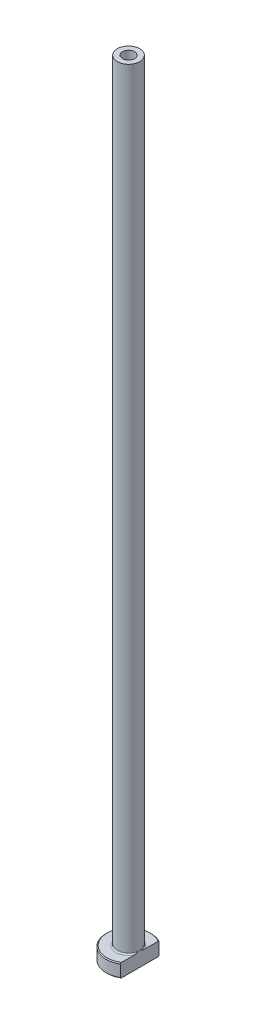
ISO-10303-21;
HEADER;
FILE_DESCRIPTION(('STEP AP214'),'2;1');
FILE_NAME('part.step','',(''),(''),'','','');
FILE_SCHEMA(('AUTOMOTIVE_DESIGN { 1 0 10303 214 1 1 1 1 }'));
ENDSEC;
DATA;
#1=APPLICATION_CONTEXT('core data for automotive mechanical design processes');
#2=APPLICATION_PROTOCOL_DEFINITION('international standard','automotive_design',2000,#1);
#3=PRODUCT_CONTEXT('',#1,'mechanical');
#4=PRODUCT('Part','Part','',(#3));
#5=PRODUCT_RELATED_PRODUCT_CATEGORY('part','',(#4));
#6=PRODUCT_DEFINITION_FORMATION('','',#4);
#7=PRODUCT_DEFINITION_CONTEXT('part definition',#1,'design');
#8=PRODUCT_DEFINITION('design','',#6,#7);
#9=PRODUCT_DEFINITION_SHAPE('','',#8);
#10=(LENGTH_UNIT() NAMED_UNIT(*) SI_UNIT(.MILLI.,.METRE.));
#11=(NAMED_UNIT(*) PLANE_ANGLE_UNIT() SI_UNIT($,.RADIAN.));
#12=(NAMED_UNIT(*) SI_UNIT($,.STERADIAN.) SOLID_ANGLE_UNIT());
#13=UNCERTAINTY_MEASURE_WITH_UNIT(LENGTH_MEASURE(1.E-05),#10,'distance_accuracy_value','');
#14=(GEOMETRIC_REPRESENTATION_CONTEXT(3) GLOBAL_UNCERTAINTY_ASSIGNED_CONTEXT((#13)) GLOBAL_UNIT_ASSIGNED_CONTEXT((#10,
#11,#12)) REPRESENTATION_CONTEXT('',''));
#15=CARTESIAN_POINT('',(0.,0.,0.));
#16=DIRECTION('',(0.,0.,1.));
#17=DIRECTION('',(1.,0.,0.));
#18=AXIS2_PLACEMENT_3D('',#15,#16,#17);
#19=CARTESIAN_POINT('',(0.,92.1876809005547,0.));
#20=DIRECTION('',(0.,1.,0.));
#21=DIRECTION('',(0.,0.,1.));
#22=AXIS2_PLACEMENT_3D('',#19,#20,#21);
#23=CYLINDRICAL_SURFACE('',#22,1.35);
#24=CARTESIAN_POINT('',(0.,175.,0.));
#25=DIRECTION('',(0.,1.,0.));
#26=DIRECTION('',(0.,0.,1.));
#27=AXIS2_PLACEMENT_3D('',#24,#25,#26);
#28=CIRCLE('',#27,1.35);
#29=CARTESIAN_POINT('',(0.,175.,1.35));
#30=VERTEX_POINT('',#29);
#31=EDGE_CURVE('E167',#30,#30,#28,.T.);
#32=ORIENTED_EDGE('',*,*,#31,.T.);
#33=EDGE_LOOP('',(#32));
#34=FACE_BOUND('',#33,.T.);
#35=CARTESIAN_POINT('',(0.,130.,0.));
#36=DIRECTION('',(0.,1.,0.));
#37=DIRECTION('',(0.,0.,1.));
#38=AXIS2_PLACEMENT_3D('',#35,#36,#37);
#39=CIRCLE('',#38,1.35);
#40=CARTESIAN_POINT('',(0.,130.,1.35));
#41=VERTEX_POINT('',#40);
#42=EDGE_CURVE('E170',#41,#41,#39,.T.);
#43=ORIENTED_EDGE('',*,*,#42,.F.);
#44=EDGE_LOOP('',(#43));
#45=FACE_BOUND('',#44,.T.);
#46=ADVANCED_FACE('F32',(#34,#45),#23,.F.);
#47=CARTESIAN_POINT('',(-1.35,175.,0.));
#48=DIRECTION('',(0.,1.,0.));
#49=DIRECTION('',(0.,0.,1.));
#50=AXIS2_PLACEMENT_3D('',#47,#48,#49);
#51=PLANE('',#50);
#52=CARTESIAN_POINT('',(0.,175.,0.));
#53=DIRECTION('',(0.,1.,0.));
#54=DIRECTION('',(0.,0.,1.));
#55=AXIS2_PLACEMENT_3D('',#52,#53,#54);
#56=CIRCLE('',#55,2.50000000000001);
#57=CARTESIAN_POINT('',(0.,175.,2.50000000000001));
#58=VERTEX_POINT('',#57);
#59=EDGE_CURVE('E174',#58,#58,#56,.T.);
#60=ORIENTED_EDGE('',*,*,#59,.T.);
#61=EDGE_LOOP('',(#60));
#62=FACE_BOUND('',#61,.T.);
#63=ORIENTED_EDGE('',*,*,#31,.F.);
#64=EDGE_LOOP('',(#63));
#65=FACE_BOUND('',#64,.T.);
#66=ADVANCED_FACE('F157',(#62,#65),#51,.T.);
#67=CARTESIAN_POINT('',(0.,92.1876809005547,0.));
#68=DIRECTION('',(0.,1.,0.));
#69=DIRECTION('',(0.,0.,1.));
#70=AXIS2_PLACEMENT_3D('',#67,#68,#69);
#71=CYLINDRICAL_SURFACE('',#70,2.5);
#72=CARTESIAN_POINT('',(0.,3.3,0.));
#73=DIRECTION('',(0.,1.,0.));
#74=DIRECTION('',(0.,0.,1.));
#75=AXIS2_PLACEMENT_3D('',#72,#73,#74);
#76=CIRCLE('',#75,2.5);
#77=CARTESIAN_POINT('',(2.5,3.3,0.));
#78=VERTEX_POINT('',#77);
#79=EDGE_CURVE('E180',#78,#78,#76,.T.);
#80=ORIENTED_EDGE('',*,*,#79,.T.);
#81=EDGE_LOOP('',(#80));
#82=FACE_BOUND('',#81,.T.);
#83=ORIENTED_EDGE('',*,*,#59,.F.);
#84=EDGE_LOOP('',(#83));
#85=FACE_BOUND('',#84,.T.);
#86=ADVANCED_FACE('F162',(#82,#85),#71,.T.);
#87=CARTESIAN_POINT('',(-2.49999999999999,3.,0.));
#88=DIRECTION('',(0.,1.,0.));
#89=DIRECTION('',(0.,0.,1.));
#90=AXIS2_PLACEMENT_3D('',#87,#88,#89);
#91=PLANE('',#90);
#92=DIRECTION('',(0.,0.,1.));
#93=VECTOR('',#92,1.);
#94=CARTESIAN_POINT('',(2.49999999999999,3.,0.));
#95=LINE('',#94,#93);
#96=CARTESIAN_POINT('',(2.5,3.,-4.09756024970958));
#97=VERTEX_POINT('',#96);
#98=CARTESIAN_POINT('',(2.49999999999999,3.,-1.26095202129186));
#99=VERTEX_POINT('',#98);
#100=EDGE_CURVE('E54',#97,#99,#95,.T.);
#101=ORIENTED_EDGE('',*,*,#100,.F.);
#102=CARTESIAN_POINT('',(0.,3.,0.));
#103=DIRECTION('',(0.,1.,0.));
#104=DIRECTION('',(0.,0.,1.));
#105=AXIS2_PLACEMENT_3D('',#102,#103,#104);
#106=CIRCLE('',#105,4.8);
#107=CARTESIAN_POINT('',(2.49999999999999,3.,4.09756024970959));
#108=VERTEX_POINT('',#107);
#109=EDGE_CURVE('E186',#97,#108,#106,.T.);
#110=ORIENTED_EDGE('',*,*,#109,.T.);
#111=CARTESIAN_POINT('',(2.49999999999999,3.,1.26095202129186));
#112=VERTEX_POINT('',#111);
#113=EDGE_CURVE('E134',#112,#108,#95,.T.);
#114=ORIENTED_EDGE('',*,*,#113,.F.);
#115=CARTESIAN_POINT('',(0.,3.,0.));
#116=DIRECTION('',(0.,1.,0.));
#117=DIRECTION('',(0.,0.,1.));
#118=AXIS2_PLACEMENT_3D('',#115,#116,#117);
#119=CIRCLE('',#118,2.8);
#120=EDGE_CURVE('E183',#112,#99,#119,.F.);
#121=ORIENTED_EDGE('',*,*,#120,.T.);
#122=EDGE_LOOP('',(#101,#110,#114,#121));
#123=FACE_BOUND('',#122,.T.);
#124=ADVANCED_FACE('F197',(#123),#91,.T.);
#125=CARTESIAN_POINT('',(0.,92.1876809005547,0.));
#126=DIRECTION('',(0.,1.,0.));
#127=DIRECTION('',(0.,0.,1.));
#128=AXIS2_PLACEMENT_3D('',#125,#126,#127);
#129=CYLINDRICAL_SURFACE('',#128,4.99999999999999);
#130=DIRECTION('',(0.,-1.,0.));
#131=VECTOR('',#130,1.);
#132=CARTESIAN_POINT('',(2.49999999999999,175.,4.33012701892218));
#133=LINE('',#132,#131);
#134=CARTESIAN_POINT('',(2.49999999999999,2.8,4.33012701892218));
#135=VERTEX_POINT('',#134);
#136=CARTESIAN_POINT('',(2.49999999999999,0.200000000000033,4.33012701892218));
#137=VERTEX_POINT('',#136);
#138=EDGE_CURVE('E82',#135,#137,#133,.T.);
#139=ORIENTED_EDGE('',*,*,#138,.F.);
#140=CARTESIAN_POINT('',(0.,2.8,0.));
#141=DIRECTION('',(0.,1.,0.));
#142=DIRECTION('',(0.,0.,1.));
#143=AXIS2_PLACEMENT_3D('',#140,#141,#142);
#144=CIRCLE('',#143,4.99999999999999);
#145=CARTESIAN_POINT('',(2.5,2.8,-4.33012701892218));
#146=VERTEX_POINT('',#145);
#147=EDGE_CURVE('E95',#135,#146,#144,.F.);
#148=ORIENTED_EDGE('',*,*,#147,.T.);
#149=DIRECTION('',(0.,-1.,0.));
#150=VECTOR('',#149,1.);
#151=CARTESIAN_POINT('',(2.5,175.,-4.33012701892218));
#152=LINE('',#151,#150);
#153=CARTESIAN_POINT('',(2.5,0.200000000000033,-4.33012701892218));
#154=VERTEX_POINT('',#153);
#155=EDGE_CURVE('E192',#146,#154,#152,.T.);
#156=ORIENTED_EDGE('',*,*,#155,.T.);
#157=CARTESIAN_POINT('',(0.,0.200000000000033,0.));
#158=DIRECTION('',(0.,-1.,0.));
#159=DIRECTION('',(0.,0.,-1.));
#160=AXIS2_PLACEMENT_3D('',#157,#158,#159);
#161=CIRCLE('',#160,4.99999999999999);
#162=EDGE_CURVE('E98',#154,#137,#161,.F.);
#163=ORIENTED_EDGE('',*,*,#162,.T.);
#164=EDGE_LOOP('',(#139,#148,#156,#163));
#165=FACE_BOUND('',#164,.T.);
#166=ADVANCED_FACE('F190',(#165),#129,.T.);
#167=CARTESIAN_POINT('',(-4.99999999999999,0.,0.));
#168=DIRECTION('',(0.,-1.,0.));
#169=DIRECTION('',(0.,0.,-1.));
#170=AXIS2_PLACEMENT_3D('',#167,#168,#169);
#171=PLANE('',#170);
#172=CARTESIAN_POINT('',(0.,0.,0.));
#173=DIRECTION('',(0.,-1.,0.));
#174=DIRECTION('',(0.,0.,-1.));
#175=AXIS2_PLACEMENT_3D('',#172,#173,#174);
#176=CIRCLE('',#175,2.09999999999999);
#177=CARTESIAN_POINT('',(0.,0.,-2.09999999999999));
#178=VERTEX_POINT('',#177);
#179=EDGE_CURVE('E40',#178,#178,#176,.F.);
#180=ORIENTED_EDGE('',*,*,#179,.T.);
#181=EDGE_LOOP('',(#180));
#182=FACE_BOUND('',#181,.T.);
#183=DIRECTION('',(0.,0.,-1.));
#184=VECTOR('',#183,1.);
#185=CARTESIAN_POINT('',(2.49999999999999,0.,4.33012701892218));
#186=LINE('',#185,#184);
#187=CARTESIAN_POINT('',(2.49999999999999,0.,4.09756024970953));
#188=VERTEX_POINT('',#187);
#189=CARTESIAN_POINT('',(2.5,0.,-4.09756024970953));
#190=VERTEX_POINT('',#189);
#191=EDGE_CURVE('E47',#188,#190,#186,.T.);
#192=ORIENTED_EDGE('',*,*,#191,.F.);
#193=CARTESIAN_POINT('',(0.,0.,0.));
#194=DIRECTION('',(0.,-1.,0.));
#195=DIRECTION('',(0.,0.,-1.));
#196=AXIS2_PLACEMENT_3D('',#193,#194,#195);
#197=CIRCLE('',#196,4.79999999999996);
#198=EDGE_CURVE('E92',#188,#190,#197,.T.);
#199=ORIENTED_EDGE('',*,*,#198,.T.);
#200=EDGE_LOOP('',(#192,#199));
#201=FACE_BOUND('',#200,.T.);
#202=ADVANCED_FACE('F91',(#182,#201),#171,.T.);
#203=CARTESIAN_POINT('',(0.,92.1876809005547,0.));
#204=DIRECTION('',(0.,1.,0.));
#205=DIRECTION('',(0.,0.,1.));
#206=AXIS2_PLACEMENT_3D('',#203,#204,#205);
#207=CYLINDRICAL_SURFACE('',#206,1.6);
#208=CARTESIAN_POINT('',(0.,0.5,0.));
#209=DIRECTION('',(0.,-1.,0.));
#210=DIRECTION('',(0.,0.,-1.));
#211=AXIS2_PLACEMENT_3D('',#208,#209,#210);
#212=CIRCLE('',#211,1.6);
#213=CARTESIAN_POINT('',(0.,0.5,-1.6));
#214=VERTEX_POINT('',#213);
#215=EDGE_CURVE('E11',#214,#214,#212,.T.);
#216=ORIENTED_EDGE('',*,*,#215,.T.);
#217=EDGE_LOOP('',(#216));
#218=FACE_BOUND('',#217,.T.);
#219=CARTESIAN_POINT('',(0.,118.,0.));
#220=DIRECTION('',(0.,1.,0.));
#221=DIRECTION('',(0.,0.,1.));
#222=AXIS2_PLACEMENT_3D('',#219,#220,#221);
#223=CIRCLE('',#222,1.6);
#224=CARTESIAN_POINT('',(0.,118.,1.6));
#225=VERTEX_POINT('',#224);
#226=EDGE_CURVE('E172',#225,#225,#223,.T.);
#227=ORIENTED_EDGE('',*,*,#226,.T.);
#228=EDGE_LOOP('',(#227));
#229=FACE_BOUND('',#228,.T.);
#230=ADVANCED_FACE('F215',(#218,#229),#207,.F.);
#231=CARTESIAN_POINT('',(0.,118.,0.));
#232=DIRECTION('',(0.,-1.,0.));
#233=DIRECTION('',(0.,0.,-1.));
#234=AXIS2_PLACEMENT_3D('',#231,#232,#233);
#235=CONICAL_SURFACE('',#234,1.6,0.0208303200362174);
#236=ORIENTED_EDGE('',*,*,#42,.T.);
#237=EDGE_LOOP('',(#236));
#238=FACE_BOUND('',#237,.T.);
#239=ORIENTED_EDGE('',*,*,#226,.F.);
#240=EDGE_LOOP('',(#239));
#241=FACE_BOUND('',#240,.T.);
#242=ADVANCED_FACE('F111',(#238,#241),#235,.F.);
#243=CARTESIAN_POINT('',(0.,3.3,0.));
#244=DIRECTION('',(0.,1.,0.));
#245=DIRECTION('',(0.,0.,1.));
#246=AXIS2_PLACEMENT_3D('',#243,#244,#245);
#247=TOROIDAL_SURFACE('',#246,2.8,0.3);
#248=ORIENTED_EDGE('',*,*,#120,.F.);
#249=CARTESIAN_POINT('',(2.5,3.3,0.));
#250=CARTESIAN_POINT('',(2.5,3.3000006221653,-4.84273808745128E-11));
#251=CARTESIAN_POINT('',(2.5,3.30000124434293,1.59621022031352E-07));
#252=CARTESIAN_POINT('',(2.5,3.30000243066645,6.45477892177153E-07));
#253=CARTESIAN_POINT('',(2.5,3.3000029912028,9.78480613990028E-07));
#254=CARTESIAN_POINT('',(2.5,3.3000041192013,1.77471968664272E-06));
#255=CARTESIAN_POINT('',(2.5,3.30000467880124,2.249021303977E-06));
#256=CARTESIAN_POINT('',(2.5,3.30000572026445,3.25953665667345E-06));
#257=CARTESIAN_POINT('',(2.5,3.30000620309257,3.79480728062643E-06));
#258=CARTESIAN_POINT('',(2.5,3.3000078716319,5.75794615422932E-06));
#259=CARTESIAN_POINT('',(2.5,3.30000896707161,7.2642410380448E-06));
#260=CARTESIAN_POINT('',(2.5,3.30001087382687,1.0336112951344E-05));
#261=CARTESIAN_POINT('',(2.5,3.30001169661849,1.18949499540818E-05));
#262=CARTESIAN_POINT('',(2.5,3.30001489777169,1.81400853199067E-05));
#263=CARTESIAN_POINT('',(2.5,3.300017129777,2.29062180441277E-05));
#264=CARTESIAN_POINT('',(2.5,3.30002067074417,3.21793870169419E-05));
#265=CARTESIAN_POINT('',(2.5,3.30002205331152,3.66588991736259E-05));
#266=CARTESIAN_POINT('',(2.5,3.30002810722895,5.61718409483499E-05));
#267=CARTESIAN_POINT('',(2.5,3.30003284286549,7.11735872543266E-05));
#268=CARTESIAN_POINT('',(2.49999999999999,3.30004025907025,9.89920336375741E-05));
#269=CARTESIAN_POINT('',(2.5,3.3000431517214,0.000111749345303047));
#270=CARTESIAN_POINT('',(2.5,3.30006652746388,0.000206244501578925));
#271=CARTESIAN_POINT('',(2.5,3.30009698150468,0.000285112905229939));
#272=CARTESIAN_POINT('',(2.49999999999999,3.30021213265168,0.000594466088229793));
#273=CARTESIAN_POINT('',(2.49999999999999,3.30028938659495,0.000826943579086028));
#274=CARTESIAN_POINT('',(2.5,3.30059681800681,0.0017388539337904));
#275=CARTESIAN_POINT('',(2.5,3.30083479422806,0.00241625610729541));
#276=CARTESIAN_POINT('',(2.49999999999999,3.30181198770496,0.00521069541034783));
#277=CARTESIAN_POINT('',(2.49999999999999,3.30254240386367,0.0073299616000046));
#278=CARTESIAN_POINT('',(2.5,3.31226043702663,0.0355096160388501));
#279=CARTESIAN_POINT('',(2.5,3.32130808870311,0.0615551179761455));
#280=CARTESIAN_POINT('',(2.49999999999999,3.33896212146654,0.112677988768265));
#281=CARTESIAN_POINT('',(2.49999999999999,3.34757212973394,0.137754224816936));
#282=CARTESIAN_POINT('',(2.5,3.36573068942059,0.190981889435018));
#283=CARTESIAN_POINT('',(2.5,3.37526654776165,0.219137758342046));
#284=CARTESIAN_POINT('',(2.5,3.39422867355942,0.275816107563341));
#285=CARTESIAN_POINT('',(2.5,3.40365272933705,0.304339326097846));
#286=CARTESIAN_POINT('',(2.5,3.42641697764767,0.374416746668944));
#287=CARTESIAN_POINT('',(2.5,3.43959811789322,0.416023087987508));
#288=CARTESIAN_POINT('',(2.5,3.46479157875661,0.49848190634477));
#289=CARTESIAN_POINT('',(2.5,3.47682455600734,0.539328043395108));
#290=CARTESIAN_POINT('',(2.5,3.50224427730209,0.629981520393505));
#291=CARTESIAN_POINT('',(2.5,3.51538048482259,0.679860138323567));
#292=CARTESIAN_POINT('',(2.5,3.53964074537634,0.7805117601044));
#293=CARTESIAN_POINT('',(2.5,3.55074877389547,0.831288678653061));
#294=CARTESIAN_POINT('',(2.5,3.57087054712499,0.937063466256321));
#295=CARTESIAN_POINT('',(2.5,3.57967623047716,0.992102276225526));
#296=CARTESIAN_POINT('',(2.5,3.59301148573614,1.10256024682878));
#297=CARTESIAN_POINT('',(2.5,3.59755297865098,1.15797790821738));
#298=CARTESIAN_POINT('',(2.5,3.60093314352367,1.26786705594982));
#299=CARTESIAN_POINT('',(2.5,3.59989366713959,1.32233291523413));
#300=CARTESIAN_POINT('',(2.5,3.59277279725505,1.40310062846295));
#301=CARTESIAN_POINT('',(2.5,3.58952137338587,1.42965222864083));
#302=CARTESIAN_POINT('',(2.5,3.58085857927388,1.48239078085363));
#303=CARTESIAN_POINT('',(2.5,3.57544928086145,1.50857805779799));
#304=CARTESIAN_POINT('',(2.5,3.56298810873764,1.55658799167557));
#305=CARTESIAN_POINT('',(2.5,3.5562820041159,1.5784990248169));
#306=CARTESIAN_POINT('',(2.5,3.5405539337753,1.62160292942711));
#307=CARTESIAN_POINT('',(2.5,3.5315222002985,1.64279233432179));
#308=CARTESIAN_POINT('',(2.5,3.51057199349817,1.68404469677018));
#309=CARTESIAN_POINT('',(2.5,3.49862012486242,1.70409105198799));
#310=CARTESIAN_POINT('',(2.5,3.47134074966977,1.74172093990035));
#311=CARTESIAN_POINT('',(2.5,3.45603127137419,1.75931683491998));
#312=CARTESIAN_POINT('',(2.5,3.42979930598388,1.78297070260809));
#313=CARTESIAN_POINT('',(2.5,3.42024268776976,1.79054141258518));
#314=CARTESIAN_POINT('',(2.5,3.40009035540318,1.80416997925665));
#315=CARTESIAN_POINT('',(2.5,3.3894949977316,1.81022835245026));
#316=CARTESIAN_POINT('',(2.5,3.36727740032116,1.82047087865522));
#317=CARTESIAN_POINT('',(2.5,3.3556453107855,1.82463409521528));
#318=CARTESIAN_POINT('',(2.5,3.33178837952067,1.83058442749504));
#319=CARTESIAN_POINT('',(2.5,3.31956435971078,1.83237474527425));
#320=CARTESIAN_POINT('',(2.5,3.29665736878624,1.83331852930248));
#321=CARTESIAN_POINT('',(2.5,3.2859867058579,1.83279233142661));
#322=CARTESIAN_POINT('',(2.5,3.26490749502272,1.82986307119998));
#323=CARTESIAN_POINT('',(2.5,3.25449899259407,1.82745968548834));
#324=CARTESIAN_POINT('',(2.5,3.23467098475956,1.82111257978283));
#325=CARTESIAN_POINT('',(2.5,3.22522816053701,1.81724026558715));
#326=CARTESIAN_POINT('',(2.5,3.20699535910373,1.80819497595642));
#327=CARTESIAN_POINT('',(2.5,3.19820556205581,1.80302164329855));
#328=CARTESIAN_POINT('',(2.5,3.17663162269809,1.78842115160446));
#329=CARTESIAN_POINT('',(2.5,3.16436228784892,1.7782329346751));
#330=CARTESIAN_POINT('',(2.5,3.14157828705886,1.75604629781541));
#331=CARTESIAN_POINT('',(2.5,3.13106906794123,1.74404246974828));
#332=CARTESIAN_POINT('',(2.5,3.10600520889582,1.71142114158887));
#333=CARTESIAN_POINT('',(2.5,3.09267476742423,1.68986887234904));
#334=CARTESIAN_POINT('',(2.5,3.06940323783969,1.64508572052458));
#335=CARTESIAN_POINT('',(2.5,3.05946314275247,1.62185434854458));
#336=CARTESIAN_POINT('',(2.5,3.03545750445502,1.55546754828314));
#337=CARTESIAN_POINT('',(2.5,3.02444022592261,1.51122187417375));
#338=CARTESIAN_POINT('',(2.5,3.00863926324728,1.4211977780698));
#339=CARTESIAN_POINT('',(2.5,3.00393876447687,1.37540689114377));
#340=CARTESIAN_POINT('',(2.5,2.9992421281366,1.28072198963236));
#341=CARTESIAN_POINT('',(2.5,2.99956098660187,1.23181420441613));
#342=CARTESIAN_POINT('',(2.5,3.00436098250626,1.13410944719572));
#343=CARTESIAN_POINT('',(2.5,3.00885327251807,1.0853131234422));
#344=CARTESIAN_POINT('',(2.5,3.02074191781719,0.990773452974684));
#345=CARTESIAN_POINT('',(2.5,3.02796792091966,0.94500781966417));
#346=CARTESIAN_POINT('',(2.5,3.04465555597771,0.854199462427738));
#347=CARTESIAN_POINT('',(2.5,3.05410250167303,0.809153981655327));
#348=CARTESIAN_POINT('',(2.5,3.07710029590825,0.709411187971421));
#349=CARTESIAN_POINT('',(2.5,3.09109633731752,0.654817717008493));
#350=CARTESIAN_POINT('',(2.5,3.12140740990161,0.54486362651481));
#351=CARTESIAN_POINT('',(2.49999999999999,3.13777040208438,0.489516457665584));
#352=CARTESIAN_POINT('',(2.5,3.16649540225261,0.396740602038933));
#353=CARTESIAN_POINT('',(2.5,3.17848130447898,0.359193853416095));
#354=CARTESIAN_POINT('',(2.49999999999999,3.20280507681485,0.284651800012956));
#355=CARTESIAN_POINT('',(2.49999999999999,3.21513791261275,0.247654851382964));
#356=CARTESIAN_POINT('',(2.5,3.23873713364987,0.177767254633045));
#357=CARTESIAN_POINT('',(2.5,3.24997409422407,0.144866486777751));
#358=CARTESIAN_POINT('',(2.49999999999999,3.27307149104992,0.0777985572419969));
#359=CARTESIAN_POINT('',(2.49999999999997,3.28493883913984,0.0436336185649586));
#360=CARTESIAN_POINT('',(2.5,3.29745794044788,0.0073287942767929));
#361=CARTESIAN_POINT('',(2.5,3.29818879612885,0.00520838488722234));
#362=CARTESIAN_POINT('',(2.49999999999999,3.29916610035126,0.00241367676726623));
#363=CARTESIAN_POINT('',(2.49999999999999,3.29940376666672,0.00173715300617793));
#364=CARTESIAN_POINT('',(2.5,3.29971082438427,0.000826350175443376));
#365=CARTESIAN_POINT('',(2.5,3.29978800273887,0.000594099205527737));
#366=CARTESIAN_POINT('',(2.49999999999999,3.299903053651,0.000285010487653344));
#367=CARTESIAN_POINT('',(2.49999999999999,3.2999334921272,0.000206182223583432));
#368=CARTESIAN_POINT('',(2.5,3.29995685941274,0.000111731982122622));
#369=CARTESIAN_POINT('',(2.5,3.29995975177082,9.89774327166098E-05));
#370=CARTESIAN_POINT('',(2.5,3.29996716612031,7.11651886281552E-05));
#371=CARTESIAN_POINT('',(2.5,3.29997189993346,5.61668096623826E-05));
#372=CARTESIAN_POINT('',(2.5,3.29997795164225,3.66576327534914E-05));
#373=CARTESIAN_POINT('',(2.5,3.2999793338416,3.21785244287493E-05));
#374=CARTESIAN_POINT('',(2.5,3.29998287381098,2.29061373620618E-05));
#375=CARTESIAN_POINT('',(2.5,3.2999851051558,1.81403659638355E-05));
#376=CARTESIAN_POINT('',(2.5,3.29998830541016,1.1895582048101E-05));
#377=CARTESIAN_POINT('',(2.5,3.29998912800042,1.03367760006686E-05));
#378=CARTESIAN_POINT('',(2.5,3.29999103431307,7.26492761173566E-06));
#379=CARTESIAN_POINT('',(2.5,3.29999212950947,5.75862257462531E-06));
#380=CARTESIAN_POINT('',(2.5,3.2999937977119,3.79542444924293E-06));
#381=CARTESIAN_POINT('',(2.5,3.29999428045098,3.26012738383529E-06));
#382=CARTESIAN_POINT('',(2.5,3.29999532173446,2.2495431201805E-06));
#383=CARTESIAN_POINT('',(2.5,3.29999588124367,1.77519875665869E-06));
#384=CARTESIAN_POINT('',(2.5,3.29999700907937,9.78856956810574E-07));
#385=CARTESIAN_POINT('',(2.5,3.29999756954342,6.45796946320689E-07));
#386=CARTESIAN_POINT('',(2.5,3.2999987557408,1.59799561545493E-07));
#387=CARTESIAN_POINT('',(2.5,3.29999937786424,4.84255823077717E-11));
#388=CARTESIAN_POINT('',(2.5,3.3,0.));
#389=B_SPLINE_CURVE_WITH_KNOTS('',3,(#249,#250,#251,#252,#253,#254,#255,#256,#257,#258,#259,
#260,#261,#262,#263,#264,#265,#266,#267,#268,#269,#270,#271,#272,#273,#274,#275,#276,#277,#278,
#279,#280,#281,#282,#283,#284,#285,#286,#287,#288,#289,#290,#291,#292,#293,#294,#295,#296,#297,
#298,#299,#300,#301,#302,#303,#304,#305,#306,#307,#308,#309,#310,#311,#312,#313,#314,#315,#316,
#317,#318,#319,#320,#321,#322,#323,#324,#325,#326,#327,#328,#329,#330,#331,#332,#333,#334,#335,
#336,#337,#338,#339,#340,#341,#342,#343,#344,#345,#346,#347,#348,#349,#350,#351,#352,#353,#354,
#355,#356,#357,#358,#359,#360,#361,#362,#363,#364,#365,#366,#367,#368,#369,#370,#371,#372,#373,
#374,#375,#376,#377,#378,#379,#380,#381,#382,#383,#384,#385,#386,#387,#388),.UNSPECIFIED.,.T.,
.F.,(4,2,2,2,2,2,2,2,2,2,2,2,2,2,2,2,2,2,2,2,2,2,2,2,2,2,2,2,2,2,2,2,2,2,2,2,2,2,2,2,2,2,2,2,2,
2,2,2,2,2,2,2,2,2,2,2,2,2,2,2,2,2,2,2,2,2,2,2,2,4),(0.,1.86789240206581E-06,
3.81549625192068E-06,6.00610486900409E-06,8.16652987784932E-06,1.37285591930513E-05,
1.90122173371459E-05,3.47597293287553E-05,4.88082622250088E-05,9.59978452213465E-05,
0.000135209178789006,0.000388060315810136,0.00112364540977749,0.0032767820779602,
0.0100024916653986,0.0927120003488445,0.172253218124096,0.261432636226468,0.351551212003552,
0.48247714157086,0.610212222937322,0.76491521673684,0.920792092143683,1.08787897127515,
1.25449733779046,1.41749285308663,1.49767530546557,1.57778095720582,1.6464248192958,
1.71536183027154,1.78512750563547,1.8545273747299,1.89099315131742,1.92744645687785,
1.96429324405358,2.00109025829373,2.0329710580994,2.06485735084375,2.09535926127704,
2.12586955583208,2.17344034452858,2.2211557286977,2.29675134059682,2.37236907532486,
2.50839721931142,2.64619971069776,2.79268284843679,2.93955855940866,3.07848421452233,
3.21651583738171,3.38554045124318,3.55865938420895,3.67689643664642,3.79388863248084,
3.89819085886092,4.00668323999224,4.01341261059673,4.01556295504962,4.01629782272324,
4.01655054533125,4.01658974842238,4.01663692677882,4.01665097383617,4.01666671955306,
4.01667200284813,4.01667756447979,4.01667972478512,4.01668191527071,4.01668386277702,
4.01668573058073),.UNSPECIFIED.);
#390=EDGE_CURVE('E126',#112,#78,#389,.T.);
#391=ORIENTED_EDGE('',*,*,#390,.T.);
#392=ORIENTED_EDGE('',*,*,#79,.F.);
#393=CARTESIAN_POINT('',(2.5,3.3,0.));
#394=CARTESIAN_POINT('',(2.5,3.2999993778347,4.84277324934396E-11));
#395=CARTESIAN_POINT('',(2.5,3.29999875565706,-1.596210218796E-07));
#396=CARTESIAN_POINT('',(2.5,3.29999756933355,-6.45477892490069E-07));
#397=CARTESIAN_POINT('',(2.5,3.2999970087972,-9.78480614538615E-07));
#398=CARTESIAN_POINT('',(2.5,3.2999958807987,-1.77471968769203E-06));
#399=CARTESIAN_POINT('',(2.5,3.29999532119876,-2.2490213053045E-06));
#400=CARTESIAN_POINT('',(2.5,3.29999427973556,-3.25953665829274E-06));
#401=CARTESIAN_POINT('',(2.5,3.29999379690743,-3.79480728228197E-06));
#402=CARTESIAN_POINT('',(2.5,3.2999921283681,-5.75794615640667E-06));
#403=CARTESIAN_POINT('',(2.5,3.29999103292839,-7.26424104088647E-06));
#404=CARTESIAN_POINT('',(2.5,3.29998912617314,-1.03361129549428E-05));
#405=CARTESIAN_POINT('',(2.5,3.29998830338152,-1.18949499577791E-05));
#406=CARTESIAN_POINT('',(2.5,3.29998510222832,-1.81400853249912E-05));
#407=CARTESIAN_POINT('',(2.5,3.29998287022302,-2.29062180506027E-05));
#408=CARTESIAN_POINT('',(2.5,3.29997932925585,-3.21793870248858E-05));
#409=CARTESIAN_POINT('',(2.5,3.2999779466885,-3.66588991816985E-05));
#410=CARTESIAN_POINT('',(2.5,3.29997189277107,-5.61718409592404E-05));
#411=CARTESIAN_POINT('',(2.5,3.29996715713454,-7.11735872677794E-05));
#412=CARTESIAN_POINT('',(2.5,3.29995974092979,-9.89920336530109E-05));
#413=CARTESIAN_POINT('',(2.5,3.29995684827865,-0.000111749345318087));
#414=CARTESIAN_POINT('',(2.49999999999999,3.29993347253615,-0.000206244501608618));
#415=CARTESIAN_POINT('',(2.49999999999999,3.29990301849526,-0.000285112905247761));
#416=CARTESIAN_POINT('',(2.5,3.29978786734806,-0.000594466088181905));
#417=CARTESIAN_POINT('',(2.5,3.29971061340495,-0.000826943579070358));
#418=CARTESIAN_POINT('',(2.49999999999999,3.29940318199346,-0.00173885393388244));
#419=CARTESIAN_POINT('',(2.49999999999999,3.29916520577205,-0.00241625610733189));
#420=CARTESIAN_POINT('',(2.5,3.29818801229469,-0.00521069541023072));
#421=CARTESIAN_POINT('',(2.5,3.29745759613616,-0.00732996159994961));
#422=CARTESIAN_POINT('',(2.49999999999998,3.28773956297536,-0.0355096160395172));
#423=CARTESIAN_POINT('',(2.49999999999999,3.27869191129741,-0.061555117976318));
#424=CARTESIAN_POINT('',(2.5,3.26103787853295,-0.112677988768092));
#425=CARTESIAN_POINT('',(2.5,3.25242787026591,-0.137754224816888));
#426=CARTESIAN_POINT('',(2.49999999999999,3.23426931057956,-0.190981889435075));
#427=CARTESIAN_POINT('',(2.49999999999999,3.22473345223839,-0.219137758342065));
#428=CARTESIAN_POINT('',(2.5,3.20577132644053,-0.275816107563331));
#429=CARTESIAN_POINT('',(2.5,3.19634727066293,-0.304339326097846));
#430=CARTESIAN_POINT('',(2.5,3.17358302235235,-0.374416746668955));
#431=CARTESIAN_POINT('',(2.5,3.16040188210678,-0.416023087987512));
#432=CARTESIAN_POINT('',(2.5,3.13520842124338,-0.498481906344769));
#433=CARTESIAN_POINT('',(2.5,3.12317544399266,-0.539328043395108));
#434=CARTESIAN_POINT('',(2.5,3.0977557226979,-0.629981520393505));
#435=CARTESIAN_POINT('',(2.5,3.0846195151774,-0.679860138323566));
#436=CARTESIAN_POINT('',(2.5,3.06035925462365,-0.780511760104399));
#437=CARTESIAN_POINT('',(2.5,3.04925122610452,-0.83128867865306));
#438=CARTESIAN_POINT('',(2.5,3.02912945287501,-0.93706346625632));
#439=CARTESIAN_POINT('',(2.5,3.02032376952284,-0.992102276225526));
#440=CARTESIAN_POINT('',(2.5,3.00698851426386,-1.10256024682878));
#441=CARTESIAN_POINT('',(2.5,3.00244702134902,-1.15797790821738));
#442=CARTESIAN_POINT('',(2.5,2.99906685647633,-1.26786705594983));
#443=CARTESIAN_POINT('',(2.5,3.00010633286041,-1.32233291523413));
#444=CARTESIAN_POINT('',(2.5,3.00722720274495,-1.40310062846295));
#445=CARTESIAN_POINT('',(2.5,3.01047862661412,-1.42965222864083));
#446=CARTESIAN_POINT('',(2.5,3.01914142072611,-1.48239078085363));
#447=CARTESIAN_POINT('',(2.5,3.02455071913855,-1.508578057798));
#448=CARTESIAN_POINT('',(2.5,3.03701189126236,-1.55658799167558));
#449=CARTESIAN_POINT('',(2.5,3.0437179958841,-1.57849902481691));
#450=CARTESIAN_POINT('',(2.5,3.0594460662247,-1.62160292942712));
#451=CARTESIAN_POINT('',(2.5,3.06847779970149,-1.64279233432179));
#452=CARTESIAN_POINT('',(2.5,3.08942800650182,-1.68404469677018));
#453=CARTESIAN_POINT('',(2.5,3.10137987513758,-1.70409105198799));
#454=CARTESIAN_POINT('',(2.5,3.12865925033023,-1.74172093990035));
#455=CARTESIAN_POINT('',(2.5,3.14396872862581,-1.75931683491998));
#456=CARTESIAN_POINT('',(2.5,3.17020069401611,-1.78297070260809));
#457=CARTESIAN_POINT('',(2.5,3.17975731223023,-1.79054141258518));
#458=CARTESIAN_POINT('',(2.5,3.19990964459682,-1.80416997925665));
#459=CARTESIAN_POINT('',(2.5,3.21050500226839,-1.81022835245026));
#460=CARTESIAN_POINT('',(2.5,3.23272259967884,-1.82047087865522));
#461=CARTESIAN_POINT('',(2.5,3.2443546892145,-1.82463409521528));
#462=CARTESIAN_POINT('',(2.5,3.26821162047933,-1.83058442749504));
#463=CARTESIAN_POINT('',(2.5,3.28043564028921,-1.83237474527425));
#464=CARTESIAN_POINT('',(2.5,3.30334263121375,-1.83331852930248));
#465=CARTESIAN_POINT('',(2.5,3.3140132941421,-1.83279233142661));
#466=CARTESIAN_POINT('',(2.5,3.33509250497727,-1.82986307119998));
#467=CARTESIAN_POINT('',(2.5,3.34550100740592,-1.82745968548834));
#468=CARTESIAN_POINT('',(2.5,3.36532901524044,-1.82111257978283));
#469=CARTESIAN_POINT('',(2.5,3.37477183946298,-1.81724026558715));
#470=CARTESIAN_POINT('',(2.5,3.39300464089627,-1.80819497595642));
#471=CARTESIAN_POINT('',(2.5,3.40179443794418,-1.80302164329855));
#472=CARTESIAN_POINT('',(2.5,3.4233683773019,-1.78842115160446));
#473=CARTESIAN_POINT('',(2.5,3.43563771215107,-1.7782329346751));
#474=CARTESIAN_POINT('',(2.5,3.45842171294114,-1.75604629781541));
#475=CARTESIAN_POINT('',(2.5,3.46893093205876,-1.74404246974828));
#476=CARTESIAN_POINT('',(2.5,3.49399479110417,-1.71142114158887));
#477=CARTESIAN_POINT('',(2.5,3.50732523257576,-1.68986887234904));
#478=CARTESIAN_POINT('',(2.5,3.53059676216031,-1.64508572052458));
#479=CARTESIAN_POINT('',(2.5,3.54053685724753,-1.62185434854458));
#480=CARTESIAN_POINT('',(2.5,3.56454249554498,-1.55546754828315));
#481=CARTESIAN_POINT('',(2.5,3.57555977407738,-1.51122187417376));
#482=CARTESIAN_POINT('',(2.5,3.59136073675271,-1.4211977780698));
#483=CARTESIAN_POINT('',(2.5,3.59606123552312,-1.37540689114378));
#484=CARTESIAN_POINT('',(2.5,3.6007578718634,-1.28072198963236));
#485=CARTESIAN_POINT('',(2.5,3.60043901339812,-1.23181420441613));
#486=CARTESIAN_POINT('',(2.5,3.59563901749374,-1.13410944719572));
#487=CARTESIAN_POINT('',(2.5,3.59114672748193,-1.08531312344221));
#488=CARTESIAN_POINT('',(2.5,3.57925808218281,-0.990773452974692));
#489=CARTESIAN_POINT('',(2.5,3.57203207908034,-0.945007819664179));
#490=CARTESIAN_POINT('',(2.5,3.55534444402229,-0.854199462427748));
#491=CARTESIAN_POINT('',(2.5,3.54589749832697,-0.809153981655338));
#492=CARTESIAN_POINT('',(2.5,3.52289970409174,-0.709411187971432));
#493=CARTESIAN_POINT('',(2.5,3.50890366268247,-0.654817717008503));
#494=CARTESIAN_POINT('',(2.5,3.47859259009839,-0.544863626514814));
#495=CARTESIAN_POINT('',(2.49999999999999,3.46222959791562,-0.489516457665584));
#496=CARTESIAN_POINT('',(2.5,3.43350459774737,-0.396740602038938));
#497=CARTESIAN_POINT('',(2.5,3.42151869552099,-0.359193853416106));
#498=CARTESIAN_POINT('',(2.49999999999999,3.39719492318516,-0.284651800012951));
#499=CARTESIAN_POINT('',(2.49999999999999,3.38486208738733,-0.247654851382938));
#500=CARTESIAN_POINT('',(2.5,3.36126286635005,-0.177767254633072));
#501=CARTESIAN_POINT('',(2.5,3.35002590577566,-0.144866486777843));
#502=CARTESIAN_POINT('',(2.49999999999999,3.32692850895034,-0.0777985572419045));
#503=CARTESIAN_POINT('',(2.49999999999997,3.31506116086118,-0.0436336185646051));
#504=CARTESIAN_POINT('',(2.5,3.30254205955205,-0.00732879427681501));
#505=CARTESIAN_POINT('',(2.5,3.30181120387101,-0.00520838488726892));
#506=CARTESIAN_POINT('',(2.49999999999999,3.30083389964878,-0.00241367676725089));
#507=CARTESIAN_POINT('',(2.49999999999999,3.30059623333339,-0.00173715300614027));
#508=CARTESIAN_POINT('',(2.5,3.30028917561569,-0.000826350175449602));
#509=CARTESIAN_POINT('',(2.5,3.30021199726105,-0.000594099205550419));
#510=CARTESIAN_POINT('',(2.49999999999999,3.30009694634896,-0.000285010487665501));
#511=CARTESIAN_POINT('',(2.49999999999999,3.30006650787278,-0.000206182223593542));
#512=CARTESIAN_POINT('',(2.5,3.30004314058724,-0.000111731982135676));
#513=CARTESIAN_POINT('',(2.5,3.30004024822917,-9.89774327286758E-05));
#514=CARTESIAN_POINT('',(2.5,3.30003283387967,-7.11651886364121E-05));
#515=CARTESIAN_POINT('',(2.5,3.30002810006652,-5.61668096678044E-05));
#516=CARTESIAN_POINT('',(2.5,3.30002204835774,-3.66576327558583E-05));
#517=CARTESIAN_POINT('',(2.5,3.30002066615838,-3.21785244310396E-05));
#518=CARTESIAN_POINT('',(2.5,3.300017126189,-2.29061373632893E-05));
#519=CARTESIAN_POINT('',(2.5,3.30001489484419,-1.81403659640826E-05));
#520=CARTESIAN_POINT('',(2.5,3.30001169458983,-1.18955820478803E-05));
#521=CARTESIAN_POINT('',(2.5,3.30001087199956,-1.03367760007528E-05));
#522=CARTESIAN_POINT('',(2.5,3.30000896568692,-7.26492761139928E-06));
#523=CARTESIAN_POINT('',(2.5,3.30000787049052,-5.75862257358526E-06));
#524=CARTESIAN_POINT('',(2.5,3.30000620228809,-3.79542444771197E-06));
#525=CARTESIAN_POINT('',(2.5,3.30000571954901,-3.26012738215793E-06));
#526=CARTESIAN_POINT('',(2.5,3.30000467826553,-2.24954311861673E-06));
#527=CARTESIAN_POINT('',(2.5,3.30000411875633,-1.77519875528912E-06));
#528=CARTESIAN_POINT('',(2.5,3.30000299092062,-9.78856955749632E-07));
#529=CARTESIAN_POINT('',(2.5,3.30000243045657,-6.45796945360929E-07));
#530=CARTESIAN_POINT('',(2.5,3.30000124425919,-1.59799560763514E-07));
#531=CARTESIAN_POINT('',(2.5,3.30000062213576,-4.8424932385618E-11));
#532=CARTESIAN_POINT('',(2.5,3.3,0.));
#533=B_SPLINE_CURVE_WITH_KNOTS('',3,(#393,#394,#395,#396,#397,#398,#399,#400,#401,#402,#403,
#404,#405,#406,#407,#408,#409,#410,#411,#412,#413,#414,#415,#416,#417,#418,#419,#420,#421,#422,
#423,#424,#425,#426,#427,#428,#429,#430,#431,#432,#433,#434,#435,#436,#437,#438,#439,#440,#441,
#442,#443,#444,#445,#446,#447,#448,#449,#450,#451,#452,#453,#454,#455,#456,#457,#458,#459,#460,
#461,#462,#463,#464,#465,#466,#467,#468,#469,#470,#471,#472,#473,#474,#475,#476,#477,#478,#479,
#480,#481,#482,#483,#484,#485,#486,#487,#488,#489,#490,#491,#492,#493,#494,#495,#496,#497,#498,
#499,#500,#501,#502,#503,#504,#505,#506,#507,#508,#509,#510,#511,#512,#513,#514,#515,#516,#517,
#518,#519,#520,#521,#522,#523,#524,#525,#526,#527,#528,#529,#530,#531,#532),.UNSPECIFIED.,.T.,
.F.,(4,2,2,2,2,2,2,2,2,2,2,2,2,2,2,2,2,2,2,2,2,2,2,2,2,2,2,2,2,2,2,2,2,2,2,2,2,2,2,2,2,2,2,2,2,
2,2,2,2,2,2,2,2,2,2,2,2,2,2,2,2,2,2,2,2,2,2,2,2,4),(0.,1.86789240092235E-06,
3.81549624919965E-06,6.0061048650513E-06,8.16652987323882E-06,1.37285591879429E-05,
1.90122173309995E-05,3.47597293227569E-05,4.88082622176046E-05,9.59978452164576E-05,
0.000135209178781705,0.000388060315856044,0.00112364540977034,0.00327678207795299,
0.0100024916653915,0.0927120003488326,0.172253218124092,0.261432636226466,0.35155121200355,
0.482477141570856,0.610212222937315,0.764915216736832,0.920792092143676,1.08787897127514,
1.25449733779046,1.41749285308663,1.49767530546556,1.57778095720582,1.64642481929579,
1.71536183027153,1.78512750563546,1.85452737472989,1.89099315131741,1.92744645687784,
1.96429324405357,2.00109025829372,2.03297105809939,2.06485735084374,2.09535926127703,
2.12586955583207,2.17344034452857,2.2211557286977,2.29675134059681,2.37236907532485,
2.50839721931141,2.64619971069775,2.79268284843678,2.93955855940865,3.07848421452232,
3.21651583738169,3.38554045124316,3.55865938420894,3.67689643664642,3.79388863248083,
3.89819085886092,4.00668323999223,4.01341261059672,4.01556295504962,4.01629782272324,
4.01655054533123,4.01658974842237,4.01663692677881,4.01665097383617,4.01666671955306,
4.01667200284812,4.01667756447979,4.01667972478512,4.01668191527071,4.01668386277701,
4.01668573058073),.UNSPECIFIED.);
#534=EDGE_CURVE('E135',#78,#99,#533,.T.);
#535=ORIENTED_EDGE('',*,*,#534,.T.);
#536=EDGE_LOOP('',(#248,#391,#392,#535));
#537=FACE_BOUND('',#536,.T.);
#538=ADVANCED_FACE('F141',(#537),#247,.F.);
#539=CARTESIAN_POINT('',(0.,3.,0.));
#540=DIRECTION('',(0.,-1.,0.));
#541=DIRECTION('',(0.,0.,-1.));
#542=AXIS2_PLACEMENT_3D('',#539,#540,#541);
#543=CONICAL_SURFACE('',#542,4.8,0.785398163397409);
#544=CARTESIAN_POINT('',(2.5,-2.05039133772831,-9.52786489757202));
#545=CARTESIAN_POINT('',(2.5,-1.84160367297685,-9.31199733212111));
#546=CARTESIAN_POINT('',(2.5,-1.63304008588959,-9.09591231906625));
#547=CARTESIAN_POINT('',(2.5,-1.21649358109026,-8.66317810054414));
#548=CARTESIAN_POINT('',(2.5,-1.00851067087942,-8.44652888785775));
#549=CARTESIAN_POINT('',(2.5,-0.593157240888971,-8.01243155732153));
#550=CARTESIAN_POINT('',(2.5,-0.385787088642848,-7.79498308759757));
#551=CARTESIAN_POINT('',(2.5,0.0280365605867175,-7.35921771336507));
#552=CARTESIAN_POINT('',(2.5,0.234490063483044,-7.14090081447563));
#553=CARTESIAN_POINT('',(2.5,0.642130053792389,-6.70748960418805));
#554=CARTESIAN_POINT('',(2.5,0.84333981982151,-6.49241720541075));
#555=CARTESIAN_POINT('',(2.5,1.24425381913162,-6.06087422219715));
#556=CARTESIAN_POINT('',(2.5,1.44395806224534,-5.84440364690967));
#557=CARTESIAN_POINT('',(2.5,1.84127751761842,-5.40963663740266));
#558=CARTESIAN_POINT('',(2.5,2.03889317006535,-5.19134060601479));
#559=CARTESIAN_POINT('',(2.5,2.43125043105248,-4.75218509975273));
#560=CARTESIAN_POINT('',(2.5,2.62599215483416,-4.53132572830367));
#561=CARTESIAN_POINT('',(2.5,2.93693788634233,-4.17181619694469));
#562=CARTESIAN_POINT('',(2.5,3.0544649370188,-4.03431188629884));
#563=CARTESIAN_POINT('',(2.5,3.28742704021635,-3.75751486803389));
#564=CARTESIAN_POINT('',(2.5,3.40286188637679,-3.61822198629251));
#565=CARTESIAN_POINT('',(2.5,3.63213234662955,-3.33586492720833));
#566=CARTESIAN_POINT('',(2.5,3.74593818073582,-3.19277645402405));
#567=CARTESIAN_POINT('',(2.5,3.96956266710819,-2.90356071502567));
#568=CARTESIAN_POINT('',(2.5,4.07938227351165,-2.75743418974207));
#569=CARTESIAN_POINT('',(2.5,4.29502410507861,-2.45881038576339));
#570=CARTESIAN_POINT('',(2.5,4.4007603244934,-2.30625006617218));
#571=CARTESIAN_POINT('',(2.5,4.55286945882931,-2.07299325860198));
#572=CARTESIAN_POINT('',(2.5,4.60252613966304,-1.99444197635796));
#573=CARTESIAN_POINT('',(2.5,4.69908164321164,-1.8356682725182));
#574=CARTESIAN_POINT('',(2.5,4.74598077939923,-1.75544604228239));
#575=CARTESIAN_POINT('',(2.5,4.83578466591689,-1.59405362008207));
#576=CARTESIAN_POINT('',(2.5,4.87873126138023,-1.51290702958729));
#577=CARTESIAN_POINT('',(2.5,4.96038600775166,-1.34852090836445));
#578=CARTESIAN_POINT('',(2.5,4.99909338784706,-1.26528100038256));
#579=CARTESIAN_POINT('',(2.5,5.1070309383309,-1.01251774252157));
#580=CARTESIAN_POINT('',(2.5,5.16843307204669,-0.83934206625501));
#581=CARTESIAN_POINT('',(2.5,5.23490554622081,-0.579703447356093));
#582=CARTESIAN_POINT('',(2.5,5.25253806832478,-0.496421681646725));
#583=CARTESIAN_POINT('',(2.5,5.2798633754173,-0.328535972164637));
#584=CARTESIAN_POINT('',(2.5,5.28955686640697,-0.243932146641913));
#585=CARTESIAN_POINT('',(2.5,5.30031768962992,-0.0744340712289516));
#586=CARTESIAN_POINT('',(2.5,5.30141176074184,0.0104584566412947));
#587=CARTESIAN_POINT('',(2.5,5.29496530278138,0.179916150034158));
#588=CARTESIAN_POINT('',(2.5,5.28742406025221,0.264481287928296));
#589=CARTESIAN_POINT('',(2.5,5.26433424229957,0.431754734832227));
#590=CARTESIAN_POINT('',(2.5,5.2488543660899,0.5144727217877));
#591=CARTESIAN_POINT('',(2.5,5.21085318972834,0.678257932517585));
#592=CARTESIAN_POINT('',(2.5,5.18833104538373,0.759324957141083));
#593=CARTESIAN_POINT('',(2.5,5.13718929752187,0.920001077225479));
#594=CARTESIAN_POINT('',(2.5,5.10853534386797,0.999599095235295));
#595=CARTESIAN_POINT('',(2.5,5.0462809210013,1.15679278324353));
#596=CARTESIAN_POINT('',(2.5,5.01268146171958,1.2343888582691));
#597=CARTESIAN_POINT('',(2.5,4.90558195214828,1.46503672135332));
#598=CARTESIAN_POINT('',(2.5,4.82601567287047,1.6152635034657));
#599=CARTESIAN_POINT('',(2.5,4.65635232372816,1.909707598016));
#600=CARTESIAN_POINT('',(2.49999999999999,4.56624199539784,2.0539170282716));
#601=CARTESIAN_POINT('',(2.49999999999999,4.37862201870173,2.33821627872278));
#602=CARTESIAN_POINT('',(2.49999999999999,4.28108460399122,2.47828761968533));
#603=CARTESIAN_POINT('',(2.49999999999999,4.08116271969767,2.75478641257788));
#604=CARTESIAN_POINT('',(2.49999999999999,3.97878070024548,2.89121565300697));
#605=CARTESIAN_POINT('',(2.49999999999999,3.76913910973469,3.16313520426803));
#606=CARTESIAN_POINT('',(2.49999999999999,3.66183307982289,3.29858952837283));
#607=CARTESIAN_POINT('',(2.49999999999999,3.44456217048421,3.56736427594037));
#608=CARTESIAN_POINT('',(2.49999999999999,3.33459700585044,3.70068446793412));
#609=CARTESIAN_POINT('',(2.49999999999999,3.11293465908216,3.96532340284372));
#610=CARTESIAN_POINT('',(2.49999999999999,3.00124232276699,4.0966462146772));
#611=CARTESIAN_POINT('',(2.49999999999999,2.77631276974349,4.35796341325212));
#612=CARTESIAN_POINT('',(2.49999999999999,2.66307552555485,4.48795777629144));
#613=CARTESIAN_POINT('',(2.49999999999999,2.36028773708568,4.83228553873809));
#614=CARTESIAN_POINT('',(2.49999999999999,2.16967435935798,5.04568363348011));
#615=CARTESIAN_POINT('',(2.49999999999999,1.78611780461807,5.47037913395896));
#616=CARTESIAN_POINT('',(2.49999999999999,1.59317456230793,5.68167648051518));
#617=CARTESIAN_POINT('',(2.49999999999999,1.20540648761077,6.10290357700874));
#618=CARTESIAN_POINT('',(2.49999999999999,1.01058005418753,6.3128318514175));
#619=CARTESIAN_POINT('',(2.49999999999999,0.619649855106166,6.73149551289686));
#620=CARTESIAN_POINT('',(2.49999999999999,0.423546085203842,6.94023089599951));
#621=CARTESIAN_POINT('',(2.49999999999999,0.0384434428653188,7.3482039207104));
#622=CARTESIAN_POINT('',(2.49999999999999,-0.150515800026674,7.54747899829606));
#623=CARTESIAN_POINT('',(2.49999999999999,-0.529153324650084,7.94534601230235));
#624=CARTESIAN_POINT('',(2.49999999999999,-0.7188316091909,8.14393794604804));
#625=CARTESIAN_POINT('',(2.49999999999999,-1.09855461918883,8.54034636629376));
#626=CARTESIAN_POINT('',(2.49999999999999,-1.28859869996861,8.73816347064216));
#627=CARTESIAN_POINT('',(2.49999999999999,-1.66916268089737,9.13333639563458));
#628=CARTESIAN_POINT('',(2.49999999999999,-1.85968257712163,9.33069222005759));
#629=CARTESIAN_POINT('',(2.49999999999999,-2.0503913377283,9.52786489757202));
#630=B_SPLINE_CURVE_WITH_KNOTS('',3,(#544,#545,#546,#547,#548,#549,#550,#551,#552,#553,#554,
#555,#556,#557,#558,#559,#560,#561,#562,#563,#564,#565,#566,#567,#568,#569,#570,#571,#572,#573,
#574,#575,#576,#577,#578,#579,#580,#581,#582,#583,#584,#585,#586,#587,#588,#589,#590,#591,#592,
#593,#594,#595,#596,#597,#598,#599,#600,#601,#602,#603,#604,#605,#606,#607,#608,#609,#610,#611,
#612,#613,#614,#615,#616,#617,#618,#619,#620,#621,#622,#623,#624,#625,#626,#627,#628,#629),
.UNSPECIFIED.,.F.,.F.,(4,2,2,2,2,2,2,2,2,2,2,2,2,2,2,2,2,2,2,2,2,2,2,2,2,2,2,2,2,2,2,2,2,2,2,2,
2,2,2,2,2,2,4),(0.,0.900955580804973,1.80192274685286,2.70335062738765,3.60477268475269,
4.48832484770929,5.37187123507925,6.25522753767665,7.13854832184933,7.68119321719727,
8.22389134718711,8.7723229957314,9.32062249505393,9.87724663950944,10.1559936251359,
10.4347088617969,10.7100145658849,10.98537024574,11.5339745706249,11.7890461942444,
12.0440951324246,12.2983507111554,12.5526272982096,12.8047396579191,13.0568822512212,
13.3104761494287,13.5640183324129,14.0732618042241,14.5831526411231,15.0950533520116,
15.6066978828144,16.1250759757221,16.6435099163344,17.1606868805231,17.6778730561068,
18.5362451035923,19.3946412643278,20.2538459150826,21.1130534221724,21.9369112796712,
22.7607723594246,23.5837145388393,24.4066499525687),.UNSPECIFIED.);
#631=EDGE_CURVE('E133',#146,#97,#630,.T.);
#632=ORIENTED_EDGE('',*,*,#631,.F.);
#633=ORIENTED_EDGE('',*,*,#147,.F.);
#634=EDGE_CURVE('E118',#108,#135,#630,.T.);
#635=ORIENTED_EDGE('',*,*,#634,.F.);
#636=ORIENTED_EDGE('',*,*,#109,.F.);
#637=EDGE_LOOP('',(#632,#633,#635,#636));
#638=FACE_BOUND('',#637,.T.);
#639=ADVANCED_FACE('F145',(#638),#543,.T.);
#640=CARTESIAN_POINT('',(0.,0.200000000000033,0.));
#641=DIRECTION('',(0.,1.,0.));
#642=DIRECTION('',(0.,0.,1.));
#643=AXIS2_PLACEMENT_3D('',#640,#641,#642);
#644=CONICAL_SURFACE('',#643,4.99999999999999,0.785398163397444);
#645=CARTESIAN_POINT('',(2.49999999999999,5.050391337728,9.52786489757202));
#646=CARTESIAN_POINT('',(2.49999999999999,4.84160367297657,9.31199733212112));
#647=CARTESIAN_POINT('',(2.49999999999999,4.63304008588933,9.09591231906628));
#648=CARTESIAN_POINT('',(2.49999999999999,4.21649358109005,8.66317810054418));
#649=CARTESIAN_POINT('',(2.49999999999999,4.00851067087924,8.44652888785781));
#650=CARTESIAN_POINT('',(2.49999999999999,3.59315724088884,8.01243155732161));
#651=CARTESIAN_POINT('',(2.49999999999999,3.38578708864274,7.79498308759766));
#652=CARTESIAN_POINT('',(2.49999999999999,2.97196343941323,7.35921771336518));
#653=CARTESIAN_POINT('',(2.49999999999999,2.76550993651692,7.14090081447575));
#654=CARTESIAN_POINT('',(2.49999999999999,2.35786994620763,6.70748960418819));
#655=CARTESIAN_POINT('',(2.49999999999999,2.15666018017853,6.4924172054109));
#656=CARTESIAN_POINT('',(2.49999999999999,1.75574618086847,6.06087422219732));
#657=CARTESIAN_POINT('',(2.49999999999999,1.55604193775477,5.84440364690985));
#658=CARTESIAN_POINT('',(2.49999999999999,1.15872248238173,5.40963663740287));
#659=CARTESIAN_POINT('',(2.49999999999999,0.961106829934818,5.191340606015));
#660=CARTESIAN_POINT('',(2.49999999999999,0.568749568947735,4.75218509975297));
#661=CARTESIAN_POINT('',(2.49999999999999,0.374007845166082,4.53132572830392));
#662=CARTESIAN_POINT('',(2.49999999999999,0.0630621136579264,4.17181619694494));
#663=CARTESIAN_POINT('',(2.49999999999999,-0.0544649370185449,4.03431188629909));
#664=CARTESIAN_POINT('',(2.49999999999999,-0.287427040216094,3.75751486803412));
#665=CARTESIAN_POINT('',(2.49999999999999,-0.402861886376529,3.61822198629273));
#666=CARTESIAN_POINT('',(2.49999999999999,-0.632132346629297,3.33586492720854));
#667=CARTESIAN_POINT('',(2.49999999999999,-0.745938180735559,3.19277645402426));
#668=CARTESIAN_POINT('',(2.49999999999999,-0.969562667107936,2.90356071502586));
#669=CARTESIAN_POINT('',(2.49999999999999,-1.0793822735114,2.75743418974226));
#670=CARTESIAN_POINT('',(2.49999999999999,-1.29502410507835,2.45881038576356));
#671=CARTESIAN_POINT('',(2.5,-1.40076032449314,2.30625006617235));
#672=CARTESIAN_POINT('',(2.5,-1.55286945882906,2.07299325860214));
#673=CARTESIAN_POINT('',(2.5,-1.60252613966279,1.99444197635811));
#674=CARTESIAN_POINT('',(2.5,-1.69908164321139,1.83566827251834));
#675=CARTESIAN_POINT('',(2.5,-1.74598077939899,1.75544604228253));
#676=CARTESIAN_POINT('',(2.5,-1.83578466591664,1.59405362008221));
#677=CARTESIAN_POINT('',(2.5,-1.87873126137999,1.51290702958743));
#678=CARTESIAN_POINT('',(2.5,-1.96038600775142,1.34852090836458));
#679=CARTESIAN_POINT('',(2.5,-1.99909338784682,1.26528100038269));
#680=CARTESIAN_POINT('',(2.5,-2.10703093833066,1.0125177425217));
#681=CARTESIAN_POINT('',(2.5,-2.16843307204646,0.839342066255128));
#682=CARTESIAN_POINT('',(2.5,-2.23490554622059,0.579703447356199));
#683=CARTESIAN_POINT('',(2.5,-2.25253806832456,0.496421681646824));
#684=CARTESIAN_POINT('',(2.5,-2.27986337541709,0.328535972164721));
#685=CARTESIAN_POINT('',(2.5,-2.28955686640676,0.243932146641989));
#686=CARTESIAN_POINT('',(2.5,-2.30031768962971,0.0744340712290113));
#687=CARTESIAN_POINT('',(2.5,-2.30141176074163,-0.0104584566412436));
#688=CARTESIAN_POINT('',(2.5,-2.29496530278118,-0.179916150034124));
#689=CARTESIAN_POINT('',(2.5,-2.28742406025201,-0.26448128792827));
#690=CARTESIAN_POINT('',(2.5,-2.26433424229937,-0.431754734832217));
#691=CARTESIAN_POINT('',(2.5,-2.2488543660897,-0.514472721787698));
#692=CARTESIAN_POINT('',(2.5,-2.21085318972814,-0.6782579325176));
#693=CARTESIAN_POINT('',(2.5,-2.18833104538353,-0.759324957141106));
#694=CARTESIAN_POINT('',(2.5,-2.13718929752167,-0.920001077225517));
#695=CARTESIAN_POINT('',(2.5,-2.10853534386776,-0.999599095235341));
#696=CARTESIAN_POINT('',(2.5,-2.04628092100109,-1.15679278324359));
#697=CARTESIAN_POINT('',(2.5,-2.01268146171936,-1.23438885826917));
#698=CARTESIAN_POINT('',(2.5,-1.90558195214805,-1.46503672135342));
#699=CARTESIAN_POINT('',(2.5,-1.82601567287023,-1.61526350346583));
#700=CARTESIAN_POINT('',(2.5,-1.65635232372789,-1.90970759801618));
#701=CARTESIAN_POINT('',(2.5,-1.56624199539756,-2.0539170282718));
#702=CARTESIAN_POINT('',(2.5,-1.37862201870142,-2.33821627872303));
#703=CARTESIAN_POINT('',(2.5,-1.28108460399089,-2.4782876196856));
#704=CARTESIAN_POINT('',(2.5,-1.08116271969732,-2.7547864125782));
#705=CARTESIAN_POINT('',(2.5,-0.978780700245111,-2.89121565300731));
#706=CARTESIAN_POINT('',(2.5,-0.769139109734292,-3.16313520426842));
#707=CARTESIAN_POINT('',(2.5,-0.661833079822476,-3.29858952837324));
#708=CARTESIAN_POINT('',(2.5,-0.444562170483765,-3.56736427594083));
#709=CARTESIAN_POINT('',(2.5,-0.334597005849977,-3.7006844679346));
#710=CARTESIAN_POINT('',(2.5,-0.112934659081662,-3.96532340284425));
#711=CARTESIAN_POINT('',(2.5,-0.00124232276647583,-4.09664621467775));
#712=CARTESIAN_POINT('',(2.5,0.223687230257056,-4.35796341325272));
#713=CARTESIAN_POINT('',(2.5,0.336924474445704,-4.48795777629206));
#714=CARTESIAN_POINT('',(2.5,0.639712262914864,-4.8322855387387));
#715=CARTESIAN_POINT('',(2.5,0.830325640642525,-5.04568363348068));
#716=CARTESIAN_POINT('',(2.5,1.21388219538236,-5.47037913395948));
#717=CARTESIAN_POINT('',(2.5,1.40682543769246,-5.68167648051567));
#718=CARTESIAN_POINT('',(2.5,1.79459351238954,-6.10290357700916));
#719=CARTESIAN_POINT('',(2.5,1.98941994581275,-6.3128318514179));
#720=CARTESIAN_POINT('',(2.5,2.38035014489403,-6.7314955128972));
#721=CARTESIAN_POINT('',(2.5,2.57645391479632,-6.94023089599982));
#722=CARTESIAN_POINT('',(2.5,2.96155655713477,-7.34820392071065));
#723=CARTESIAN_POINT('',(2.5,3.15051580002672,-7.54747899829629));
#724=CARTESIAN_POINT('',(2.5,3.52915332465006,-7.94534601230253));
#725=CARTESIAN_POINT('',(2.5,3.71883160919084,-8.14393794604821));
#726=CARTESIAN_POINT('',(2.5,4.0985546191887,-8.54034636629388));
#727=CARTESIAN_POINT('',(2.5,4.28859869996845,-8.73816347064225));
#728=CARTESIAN_POINT('',(2.5,4.66916268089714,-9.13333639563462));
#729=CARTESIAN_POINT('',(2.5,4.85968257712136,-9.33069222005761));
#730=CARTESIAN_POINT('',(2.5,5.050391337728,-9.52786489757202));
#731=B_SPLINE_CURVE_WITH_KNOTS('',3,(#645,#646,#647,#648,#649,#650,#651,#652,#653,#654,#655,
#656,#657,#658,#659,#660,#661,#662,#663,#664,#665,#666,#667,#668,#669,#670,#671,#672,#673,#674,
#675,#676,#677,#678,#679,#680,#681,#682,#683,#684,#685,#686,#687,#688,#689,#690,#691,#692,#693,
#694,#695,#696,#697,#698,#699,#700,#701,#702,#703,#704,#705,#706,#707,#708,#709,#710,#711,#712,
#713,#714,#715,#716,#717,#718,#719,#720,#721,#722,#723,#724,#725,#726,#727,#728,#729,#730),
.UNSPECIFIED.,.F.,.F.,(4,2,2,2,2,2,2,2,2,2,2,2,2,2,2,2,2,2,2,2,2,2,2,2,2,2,2,2,2,2,2,2,2,2,2,2,
2,2,2,2,2,2,4),(0.,0.900955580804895,1.8019227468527,2.70335062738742,3.60477268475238,
4.48832484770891,5.37187123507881,6.25522753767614,7.13854832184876,7.68119321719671,
8.22389134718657,8.77232299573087,9.32062249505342,9.87724663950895,10.1559936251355,
10.4347088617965,10.7100145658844,10.9853702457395,11.5339745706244,11.789046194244,
12.0440951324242,12.298350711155,12.5526272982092,12.8047396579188,13.0568822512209,
13.3104761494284,13.5640183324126,14.0732618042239,14.583152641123,15.0950533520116,
15.6066978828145,16.1250759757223,16.6435099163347,17.1606868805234,17.6778730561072,
18.5362451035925,19.3946412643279,20.2538459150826,21.1130534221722,21.9369112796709,
22.7607723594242,23.5837145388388,24.4066499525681),.UNSPECIFIED.);
#732=EDGE_CURVE('E79',#137,#188,#731,.T.);
#733=ORIENTED_EDGE('',*,*,#732,.F.);
#734=ORIENTED_EDGE('',*,*,#162,.F.);
#735=EDGE_CURVE('E87',#190,#154,#731,.T.);
#736=ORIENTED_EDGE('',*,*,#735,.F.);
#737=ORIENTED_EDGE('',*,*,#198,.F.);
#738=EDGE_LOOP('',(#733,#734,#736,#737));
#739=FACE_BOUND('',#738,.T.);
#740=ADVANCED_FACE('F94',(#739),#644,.T.);
#741=CARTESIAN_POINT('',(2.49999999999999,175.,4.33012701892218));
#742=DIRECTION('',(-1.,0.,0.));
#743=DIRECTION('',(0.,0.,1.));
#744=AXIS2_PLACEMENT_3D('',#741,#742,#743);
#745=PLANE('',#744);
#746=ORIENTED_EDGE('',*,*,#390,.F.);
#747=ORIENTED_EDGE('',*,*,#113,.T.);
#748=ORIENTED_EDGE('',*,*,#634,.T.);
#749=ORIENTED_EDGE('',*,*,#138,.T.);
#750=ORIENTED_EDGE('',*,*,#732,.T.);
#751=ORIENTED_EDGE('',*,*,#191,.T.);
#752=ORIENTED_EDGE('',*,*,#735,.T.);
#753=ORIENTED_EDGE('',*,*,#155,.F.);
#754=ORIENTED_EDGE('',*,*,#631,.T.);
#755=ORIENTED_EDGE('',*,*,#100,.T.);
#756=ORIENTED_EDGE('',*,*,#534,.F.);
#757=EDGE_LOOP('',(#746,#747,#748,#749,#750,#751,#752,#753,#754,#755,#756));
#758=FACE_BOUND('',#757,.T.);
#759=ADVANCED_FACE('F80',(#758),#745,.F.);
#760=CARTESIAN_POINT('',(0.,0.,0.));
#761=DIRECTION('',(0.,-1.,0.));
#762=DIRECTION('',(0.,0.,-1.));
#763=AXIS2_PLACEMENT_3D('',#760,#761,#762);
#764=CONICAL_SURFACE('',#763,2.09999999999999,0.785398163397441);
#765=ORIENTED_EDGE('',*,*,#215,.F.);
#766=EDGE_LOOP('',(#765));
#767=FACE_BOUND('',#766,.T.);
#768=ORIENTED_EDGE('',*,*,#179,.F.);
#769=EDGE_LOOP('',(#768));
#770=FACE_BOUND('',#769,.T.);
#771=ADVANCED_FACE('F34',(#767,#770),#764,.F.);
#772=CLOSED_SHELL('',(#46,#66,#86,#124,#166,#202,#230,#242,#538,#639,#740,#759,#771));
#773=MANIFOLD_SOLID_BREP('B2',#772);
#774=ADVANCED_BREP_SHAPE_REPRESENTATION('',(#18,#773),#14);
#775=SHAPE_DEFINITION_REPRESENTATION(#9,#774);
ENDSEC;
END-ISO-10303-21;
